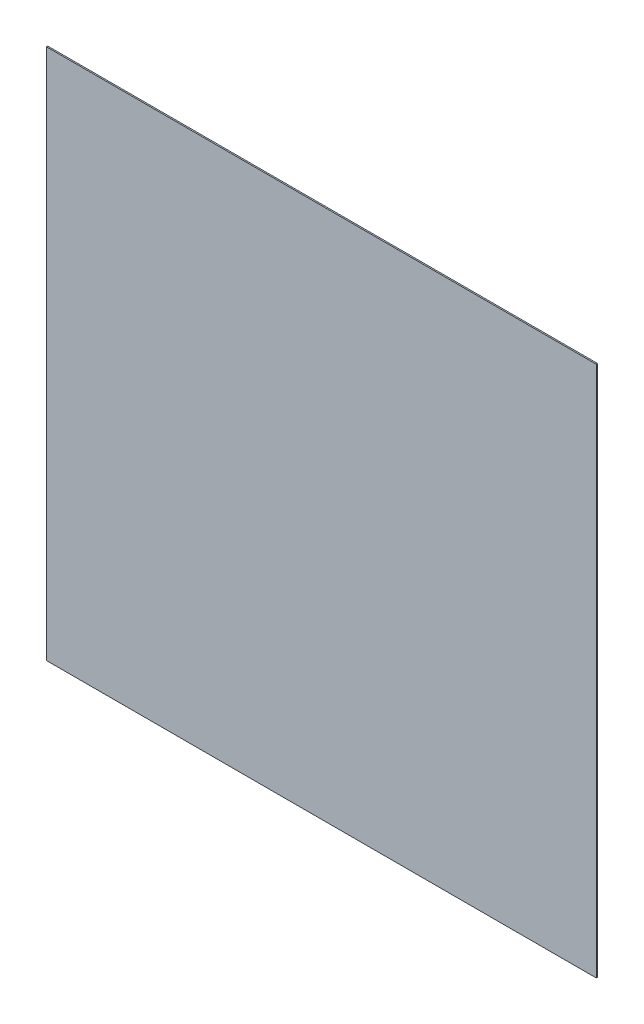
from build123d import *

# Parameters (mm, degrees)
MODEL_W                 = 210.000000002
MODEL_H                 = 201.99999995
BOSS_EXTRU_1_DEPTH      = 0.5
ESQUISSE1_W             = 9.954913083
ESQUISSE1_H             = 211.541903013
ENL_V_MAT_EXTRU_1_DEPTH = 1104.655664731


with BuildPart() as part:
    # Model → Boss.-Extru.1 (new body)
    with BuildSketch(Plane.XY):
        with Locations((918.143322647, 312.803477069)):
            Rectangle(MODEL_W, MODEL_H)
    extrude(amount=BOSS_EXTRU_1_DEPTH)

    # Esquisse1 → Enl_v. mat.-Extru.1 (cut, through all)
    with BuildSketch(Plane.XY.offset(0.5)):
        with Locations((809.165866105, 314.047841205)):
            Rectangle(ESQUISSE1_W, ESQUISSE1_H)
    extrude(amount=-ENL_V_MAT_EXTRU_1_DEPTH, mode=Mode.SUBTRACT)


solid = part.part
